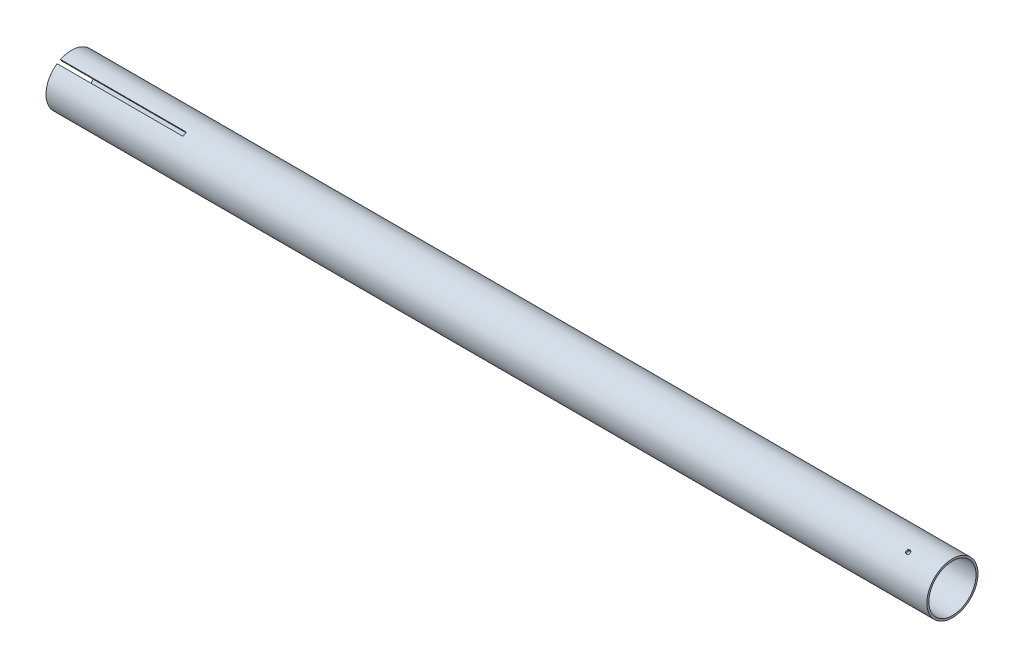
from build123d import *

# Parameters (mm, degrees)
SKETCH1_R          = 20.6375
SKETCH1_R_2        = 19.05
EXTRUDE1_DEPTH     = 711.2
SKETCH3_R          = 1.5875
CUT_EXTRUDE1_DEPTH = 712.79860411
SKETCH4_R          = 1.5875
CUT_EXTRUDE2_DEPTH = 712.798604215
SKETCH5_R          = 1.5875
CUT_EXTRUDE3_DEPTH = 712.798604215
SKETCH6_W          = 101.6
SKETCH6_H          = 3.175
CUT_EXTRUDE4_DEPTH = 712.798604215
SKETCH7_W          = 101.6
SKETCH7_H          = 3.175
CUT_EXTRUDE5_DEPTH = 712.798604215
SKETCH8_W          = 101.6
SKETCH8_H          = 3.175
CUT_EXTRUDE6_DEPTH = 712.798604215


with BuildPart() as part:
    # Sketch1 → Extrude1 (new body)
    with BuildSketch(Plane(origin=(0, 0, 0), x_dir=(0, 0, -1), z_dir=(1, 0, 0))):
        Circle(SKETCH1_R)
        Circle(SKETCH1_R_2, mode=Mode.SUBTRACT)
    extrude(amount=EXTRUDE1_DEPTH)

    # Sketch3 → Cut-Extrude1 (cut, through all)
    with BuildSketch(Plane.XY):
        with Locations((685.8, 0)):
            Circle(SKETCH3_R)
    extrude(amount=-CUT_EXTRUDE1_DEPTH, mode=Mode.SUBTRACT)

    # Sketch4 → Cut-Extrude2 (cut, through all)
    with BuildSketch(Plane(origin=(0, 0, 0), x_dir=(1, 0, 0), z_dir=(0, -0.8660254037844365, -0.500000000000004))):
        with Locations(Location((685.8, 0, 0), (0, 0, 270))):
            Circle(SKETCH4_R)
    extrude(amount=-CUT_EXTRUDE2_DEPTH, mode=Mode.SUBTRACT)

    # Sketch5 → Cut-Extrude3 (cut, through all)
    with BuildSketch(Plane(origin=(0, 0, 0), x_dir=(-1, 0, 0), z_dir=(0, 0.8660254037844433, -0.49999999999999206))):
        with Locations(Location((-685.8, 0, 0), (0, 0, 90))):
            Circle(SKETCH5_R)
    extrude(amount=-CUT_EXTRUDE3_DEPTH, mode=Mode.SUBTRACT)

    # Sketch6 → Cut-Extrude4 (cut, through all)
    with BuildSketch(Plane.XY):
        with Locations((50.8, 0)):
            Rectangle(SKETCH6_W, SKETCH6_H)
    extrude(amount=-CUT_EXTRUDE4_DEPTH, mode=Mode.SUBTRACT)

    # Sketch7 → Cut-Extrude5 (cut, through all)
    with BuildSketch(Plane(origin=(0, 0, 0), x_dir=(1, 0, 0), z_dir=(0, -0.8660254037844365, -0.500000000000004))):
        with Locations((50.8, 0)):
            Rectangle(SKETCH7_W, SKETCH7_H)
    extrude(amount=-CUT_EXTRUDE5_DEPTH, mode=Mode.SUBTRACT)

    # Sketch8 → Cut-Extrude6 (cut, through all)
    with BuildSketch(Plane(origin=(0, 0, 0), x_dir=(-1, 0, 0), z_dir=(0, 0.8660254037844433, -0.49999999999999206))):
        with Locations((-50.8, 0)):
            Rectangle(SKETCH8_W, SKETCH8_H)
    extrude(amount=-CUT_EXTRUDE6_DEPTH, mode=Mode.SUBTRACT)


solid = part.part
